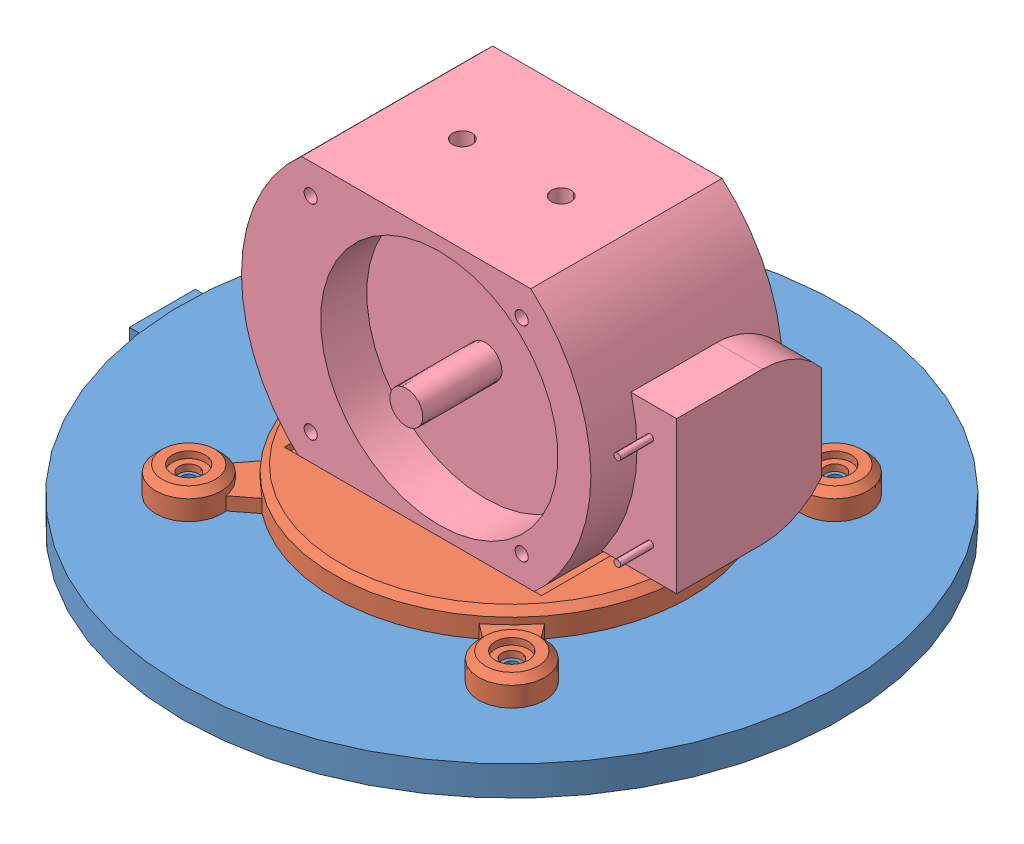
SolidWorks assembly RDM - Motor 2.sldasm, configuration Predeterminado (file format 6000). Lengths in mm.
Overall size (103 60.5 100).
4 component instances, 4 part files, 0 mates.
Components (placement in the parent):
- RDM - Soporte base M1-1: RDM - Soporte base M1.sldprt [Predeterminado] at origin size (103 11.5 100)
- RDM - Base M1_Sin vaciado-1: RDM - Base M1_Sin vaciado.sldprt [Predeterminado] at (0 -1 0) size (59 5 59)
- RDM - Engrane-1: RDM - Engrane.sldprt [Predeterminado] at (0 -7 0) x (-1 0 0) z (0 0 1) size (36 10.5 36)
- RDM - Motor-1: RDM - Motor.sldprt [Predeterminado] at (3.5 23 14.5) x (0 1 0) z (0 0 1) size (40 59 39)
